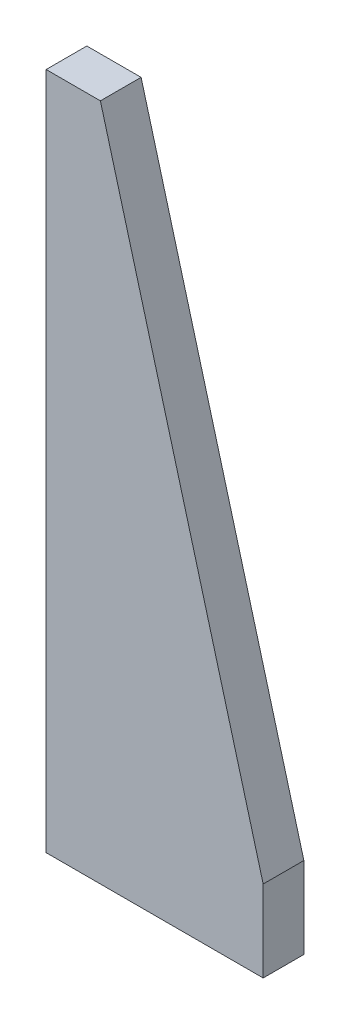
from build123d import *

# Parameters (mm, degrees)
BOSS_EXTRUDE1_DEPTH = 15


with BuildPart() as part:
    # Sketch1 → Boss-Extrude1 (new body)
    with BuildSketch(Plane.XY):
        Polygon((80, 0), (0, 0), (0, 250), (20, 250), (80, 30), align=None)
    extrude(amount=BOSS_EXTRUDE1_DEPTH)


solid = part.part
